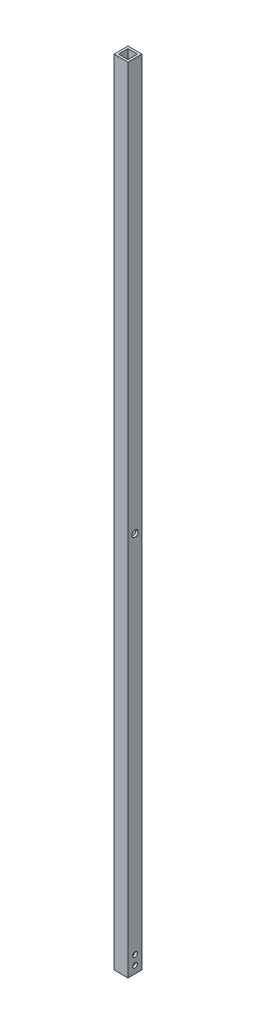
from build123d import *

# Parameters (mm, degrees)
SKETCH3_W                       = 9.525
SKETCH3_H                       = 9.525
SKETCH3_W_2                     = 6.35
SKETCH3_H_2                     = 6.35
BOSS_EXTRUDE1_DEPTH             = 538.48
F_1_8_0_125_DIAMETER_HOLE1_D    = 3.175
F_10_0_1935_DIAMETER_HOLE1_D    = 4.3053
F_1_4_0_25_DIAMETER_HOLE1_D     = 6.35
F_1_4_0_25_DIAMETER_HOLE1_DEPTH = 2.54
F_1_4_0_25_DIAMETER_HOLE1_TIP   = 1.907732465


with BuildPart() as part:
    # Sketch3 → Boss-Extrude1 (new body)
    with BuildSketch(Plane(origin=(0, 0, 0), x_dir=(1, 0, 0), z_dir=(0, 1, 0))):
        Rectangle(SKETCH3_W, SKETCH3_H)
        Rectangle(SKETCH3_W_2, SKETCH3_H_2, mode=Mode.SUBTRACT)
    extrude(amount=BOSS_EXTRUDE1_DEPTH)

    # 1_8 _0.125_ Diameter Hole1 (through all)
    with Locations(Plane.ZY.offset(4.7625)):
        with Locations((0, 5.08), (0, 11.43)):
            Hole(F_1_8_0_125_DIAMETER_HOLE1_D / 2)

    # 10 _0.1935_ Diameter Hole1 (through all)
    with Locations(Plane.ZY.offset(4.7625)):
        with Locations((0, 258.92125)):
            Hole(F_10_0_1935_DIAMETER_HOLE1_D / 2)

    # 1_4 _0.25_ Diameter Hole1
    with Locations(Plane.ZY.offset(4.7625)):
        with Locations((0, 258.92125)):
            Hole(F_1_4_0_25_DIAMETER_HOLE1_D / 2, depth=F_1_4_0_25_DIAMETER_HOLE1_DEPTH)
            with Locations((0, 0, -(F_1_4_0_25_DIAMETER_HOLE1_DEPTH + F_1_4_0_25_DIAMETER_HOLE1_TIP / 2))):  # 118° drill point
                Cone(0, F_1_4_0_25_DIAMETER_HOLE1_D / 2, F_1_4_0_25_DIAMETER_HOLE1_TIP, mode=Mode.SUBTRACT)


solid = part.part
